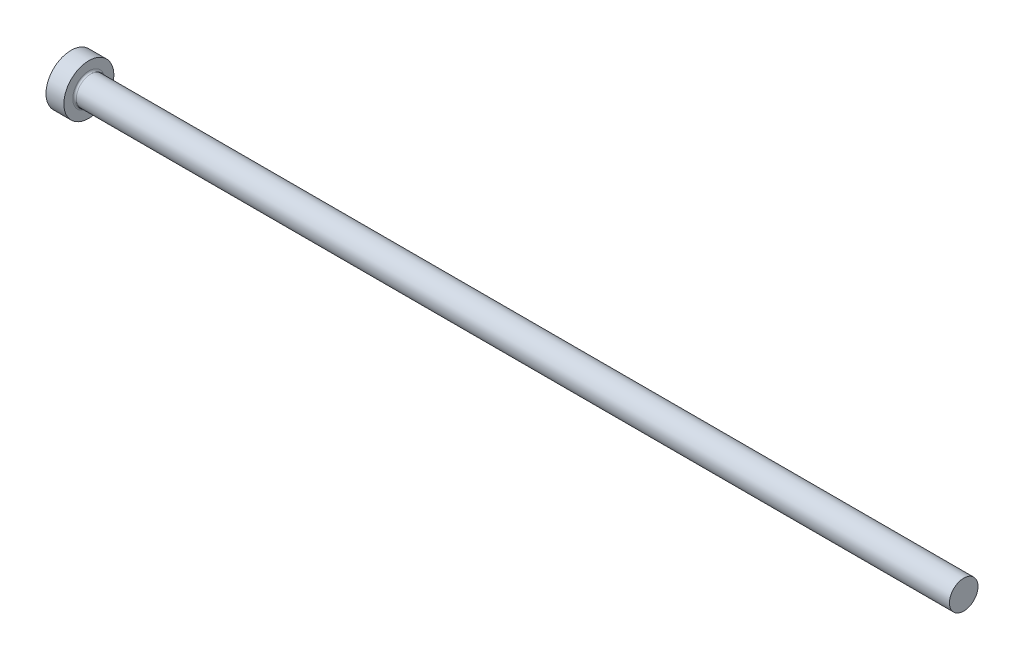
ISO-10303-21;
HEADER;
FILE_DESCRIPTION(('STEP AP214'),'2;1');
FILE_NAME('part.step','',(''),(''),'','','');
FILE_SCHEMA(('AUTOMOTIVE_DESIGN { 1 0 10303 214 1 1 1 1 }'));
ENDSEC;
DATA;
#1=APPLICATION_CONTEXT('core data for automotive mechanical design processes');
#2=APPLICATION_PROTOCOL_DEFINITION('international standard','automotive_design',2000,#1);
#3=PRODUCT_CONTEXT('',#1,'mechanical');
#4=PRODUCT('Part','Part','',(#3));
#5=PRODUCT_RELATED_PRODUCT_CATEGORY('part','',(#4));
#6=PRODUCT_DEFINITION_FORMATION('','',#4);
#7=PRODUCT_DEFINITION_CONTEXT('part definition',#1,'design');
#8=PRODUCT_DEFINITION('design','',#6,#7);
#9=PRODUCT_DEFINITION_SHAPE('','',#8);
#10=(LENGTH_UNIT() NAMED_UNIT(*) SI_UNIT(.MILLI.,.METRE.));
#11=(NAMED_UNIT(*) PLANE_ANGLE_UNIT() SI_UNIT($,.RADIAN.));
#12=(NAMED_UNIT(*) SI_UNIT($,.STERADIAN.) SOLID_ANGLE_UNIT());
#13=UNCERTAINTY_MEASURE_WITH_UNIT(LENGTH_MEASURE(1.E-05),#10,'distance_accuracy_value','');
#14=(GEOMETRIC_REPRESENTATION_CONTEXT(3) GLOBAL_UNCERTAINTY_ASSIGNED_CONTEXT((#13)) GLOBAL_UNIT_ASSIGNED_CONTEXT((#10,
#11,#12)) REPRESENTATION_CONTEXT('',''));
#15=CARTESIAN_POINT('',(0.,0.,0.));
#16=DIRECTION('',(0.,0.,1.));
#17=DIRECTION('',(1.,0.,0.));
#18=AXIS2_PLACEMENT_3D('',#15,#16,#17);
#19=CARTESIAN_POINT('',(0.,0.,0.));
#20=DIRECTION('',(-1.,0.,0.));
#21=DIRECTION('',(0.,-1.,0.));
#22=AXIS2_PLACEMENT_3D('',#19,#20,#21);
#23=PLANE('',#22);
#24=CARTESIAN_POINT('',(0.,0.,0.));
#25=DIRECTION('',(1.,0.,0.));
#26=DIRECTION('',(0.,1.,0.));
#27=AXIS2_PLACEMENT_3D('',#24,#25,#26);
#28=CIRCLE('',#27,7.);
#29=CARTESIAN_POINT('',(0.,7.,0.));
#30=VERTEX_POINT('',#29);
#31=EDGE_CURVE('E25',#30,#30,#28,.T.);
#32=ORIENTED_EDGE('',*,*,#31,.F.);
#33=EDGE_LOOP('',(#32));
#34=FACE_BOUND('',#33,.T.);
#35=ADVANCED_FACE('F14',(#34),#23,.T.);
#36=CARTESIAN_POINT('',(250.,0.,0.));
#37=DIRECTION('',(1.,0.,0.));
#38=DIRECTION('',(0.,1.,0.));
#39=AXIS2_PLACEMENT_3D('',#36,#37,#38);
#40=CYLINDRICAL_SURFACE('',#39,7.);
#41=ORIENTED_EDGE('',*,*,#31,.T.);
#42=EDGE_LOOP('',(#41));
#43=FACE_BOUND('',#42,.T.);
#44=CARTESIAN_POINT('',(5.,0.,0.));
#45=DIRECTION('',(1.,0.,0.));
#46=DIRECTION('',(0.,1.,0.));
#47=AXIS2_PLACEMENT_3D('',#44,#45,#46);
#48=CIRCLE('',#47,7.);
#49=CARTESIAN_POINT('',(5.,7.,0.));
#50=VERTEX_POINT('',#49);
#51=EDGE_CURVE('E29',#50,#50,#48,.T.);
#52=ORIENTED_EDGE('',*,*,#51,.F.);
#53=EDGE_LOOP('',(#52));
#54=FACE_BOUND('',#53,.T.);
#55=ADVANCED_FACE('F51',(#43,#54),#40,.T.);
#56=CARTESIAN_POINT('',(5.,7.,0.));
#57=DIRECTION('',(1.,0.,0.));
#58=DIRECTION('',(0.,1.,0.));
#59=AXIS2_PLACEMENT_3D('',#56,#57,#58);
#60=PLANE('',#59);
#61=CARTESIAN_POINT('',(5.,0.,0.));
#62=DIRECTION('',(1.,0.,0.));
#63=DIRECTION('',(0.,1.,0.));
#64=AXIS2_PLACEMENT_3D('',#61,#62,#63);
#65=CIRCLE('',#64,4.49999999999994);
#66=CARTESIAN_POINT('',(5.,4.49999999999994,0.));
#67=VERTEX_POINT('',#66);
#68=EDGE_CURVE('E9',#67,#67,#65,.F.);
#69=ORIENTED_EDGE('',*,*,#68,.T.);
#70=EDGE_LOOP('',(#69));
#71=FACE_BOUND('',#70,.T.);
#72=ORIENTED_EDGE('',*,*,#51,.T.);
#73=EDGE_LOOP('',(#72));
#74=FACE_BOUND('',#73,.T.);
#75=ADVANCED_FACE('F42',(#71,#74),#60,.T.);
#76=CARTESIAN_POINT('',(250.,0.,0.));
#77=DIRECTION('',(1.,0.,0.));
#78=DIRECTION('',(0.,1.,0.));
#79=AXIS2_PLACEMENT_3D('',#76,#77,#78);
#80=CYLINDRICAL_SURFACE('',#79,3.99999999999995);
#81=CARTESIAN_POINT('',(5.5,0.,0.));
#82=DIRECTION('',(1.,0.,0.));
#83=DIRECTION('',(0.,1.,0.));
#84=AXIS2_PLACEMENT_3D('',#81,#82,#83);
#85=CIRCLE('',#84,3.99999999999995);
#86=CARTESIAN_POINT('',(5.5,3.99999999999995,0.));
#87=VERTEX_POINT('',#86);
#88=EDGE_CURVE('E21',#87,#87,#85,.T.);
#89=ORIENTED_EDGE('',*,*,#88,.T.);
#90=EDGE_LOOP('',(#89));
#91=FACE_BOUND('',#90,.T.);
#92=CARTESIAN_POINT('',(250.,0.,0.));
#93=DIRECTION('',(1.,0.,0.));
#94=DIRECTION('',(0.,1.,0.));
#95=AXIS2_PLACEMENT_3D('',#92,#93,#94);
#96=CIRCLE('',#95,4.);
#97=CARTESIAN_POINT('',(250.,4.00000000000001,0.));
#98=VERTEX_POINT('',#97);
#99=EDGE_CURVE('E34',#98,#98,#96,.T.);
#100=ORIENTED_EDGE('',*,*,#99,.F.);
#101=EDGE_LOOP('',(#100));
#102=FACE_BOUND('',#101,.T.);
#103=ADVANCED_FACE('F40',(#91,#102),#80,.T.);
#104=CARTESIAN_POINT('',(250.,4.,0.));
#105=DIRECTION('',(1.,0.,0.));
#106=DIRECTION('',(0.,1.,0.));
#107=AXIS2_PLACEMENT_3D('',#104,#105,#106);
#108=PLANE('',#107);
#109=ORIENTED_EDGE('',*,*,#99,.T.);
#110=EDGE_LOOP('',(#109));
#111=FACE_BOUND('',#110,.T.);
#112=ADVANCED_FACE('F38',(#111),#108,.T.);
#113=CARTESIAN_POINT('',(5.5,0.,0.));
#114=DIRECTION('',(1.,0.,0.));
#115=DIRECTION('',(0.,1.,0.));
#116=AXIS2_PLACEMENT_3D('',#113,#114,#115);
#117=TOROIDAL_SURFACE('',#116,4.49999999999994,0.5);
#118=ORIENTED_EDGE('',*,*,#68,.F.);
#119=EDGE_LOOP('',(#118));
#120=FACE_BOUND('',#119,.T.);
#121=ORIENTED_EDGE('',*,*,#88,.F.);
#122=EDGE_LOOP('',(#121));
#123=FACE_BOUND('',#122,.T.);
#124=ADVANCED_FACE('F16',(#120,#123),#117,.F.);
#125=CLOSED_SHELL('',(#35,#55,#75,#103,#112,#124));
#126=MANIFOLD_SOLID_BREP('B1',#125);
#127=ADVANCED_BREP_SHAPE_REPRESENTATION('',(#18,#126),#14);
#128=SHAPE_DEFINITION_REPRESENTATION(#9,#127);
ENDSEC;
END-ISO-10303-21;
